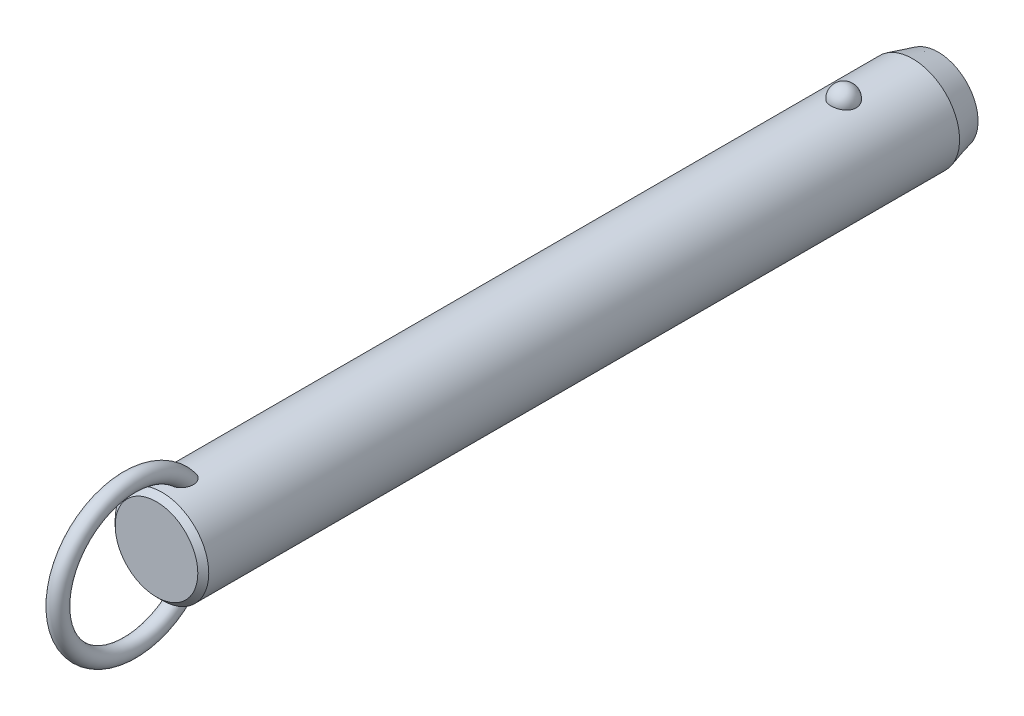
ISO-10303-21;
HEADER;
FILE_DESCRIPTION(('STEP AP214'),'2;1');
FILE_NAME('part.step','',(''),(''),'','','');
FILE_SCHEMA(('AUTOMOTIVE_DESIGN { 1 0 10303 214 1 1 1 1 }'));
ENDSEC;
DATA;
#1=APPLICATION_CONTEXT('core data for automotive mechanical design processes');
#2=APPLICATION_PROTOCOL_DEFINITION('international standard','automotive_design',2000,#1);
#3=PRODUCT_CONTEXT('',#1,'mechanical');
#4=PRODUCT('Part','Part','',(#3));
#5=PRODUCT_RELATED_PRODUCT_CATEGORY('part','',(#4));
#6=PRODUCT_DEFINITION_FORMATION('','',#4);
#7=PRODUCT_DEFINITION_CONTEXT('part definition',#1,'design');
#8=PRODUCT_DEFINITION('design','',#6,#7);
#9=PRODUCT_DEFINITION_SHAPE('','',#8);
#10=(LENGTH_UNIT() NAMED_UNIT(*) SI_UNIT(.MILLI.,.METRE.));
#11=(NAMED_UNIT(*) PLANE_ANGLE_UNIT() SI_UNIT($,.RADIAN.));
#12=(NAMED_UNIT(*) SI_UNIT($,.STERADIAN.) SOLID_ANGLE_UNIT());
#13=UNCERTAINTY_MEASURE_WITH_UNIT(LENGTH_MEASURE(1.E-05),#10,'distance_accuracy_value','');
#14=(GEOMETRIC_REPRESENTATION_CONTEXT(3) GLOBAL_UNCERTAINTY_ASSIGNED_CONTEXT((#13)) GLOBAL_UNIT_ASSIGNED_CONTEXT((#10,
#11,#12)) REPRESENTATION_CONTEXT('',''));
#15=CARTESIAN_POINT('',(0.,0.,0.));
#16=DIRECTION('',(0.,0.,1.));
#17=DIRECTION('',(1.,0.,0.));
#18=AXIS2_PLACEMENT_3D('',#15,#16,#17);
#19=CARTESIAN_POINT('',(0.,0.,147.3));
#20=DIRECTION('',(0.,0.,-1.));
#21=DIRECTION('',(-1.,0.,0.));
#22=AXIS2_PLACEMENT_3D('',#19,#20,#21);
#23=CYLINDRICAL_SURFACE('',#22,11.1);
#24=CARTESIAN_POINT('',(2.9724815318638,10.6945945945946,-3.));
#25=CARTESIAN_POINT('',(2.97247830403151,10.6945972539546,-2.83225059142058));
#26=CARTESIAN_POINT('',(2.95876598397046,10.6984356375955,-2.66445972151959));
#27=CARTESIAN_POINT('',(2.90424529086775,10.7133624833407,-2.33362381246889));
#28=CARTESIAN_POINT('',(2.8634252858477,10.7244540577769,-2.1705808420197));
#29=CARTESIAN_POINT('',(2.75573657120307,10.7526272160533,-1.85396767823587));
#30=CARTESIAN_POINT('',(2.68887937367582,10.7697061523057,-1.70039333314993));
#31=CARTESIAN_POINT('',(2.53079696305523,10.8079438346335,-1.40691598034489));
#32=CARTESIAN_POINT('',(2.43957264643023,10.8291024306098,-1.2670124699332));
#33=CARTESIAN_POINT('',(2.23458150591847,10.8732541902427,-1.00409565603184));
#34=CARTESIAN_POINT('',(2.12071295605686,10.8962553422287,-0.881162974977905));
#35=CARTESIAN_POINT('',(1.87365402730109,10.9414421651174,-0.656352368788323));
#36=CARTESIAN_POINT('',(1.74046358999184,10.9636278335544,-0.554474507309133));
#37=CARTESIAN_POINT('',(1.45872188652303,11.0046495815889,-0.374872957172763));
#38=CARTESIAN_POINT('',(1.31021276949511,11.0234944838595,-0.297085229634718));
#39=CARTESIAN_POINT('',(1.00170030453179,11.0557957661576,-0.167529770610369));
#40=CARTESIAN_POINT('',(0.841698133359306,11.0692526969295,-0.115759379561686));
#41=CARTESIAN_POINT('',(0.517607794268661,11.0890932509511,-0.0403925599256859));
#42=CARTESIAN_POINT('',(0.353633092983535,11.0955916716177,-0.0163383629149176));
#43=CARTESIAN_POINT('',(0.0238420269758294,11.1011989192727,0.0044517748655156));
#44=CARTESIAN_POINT('',(-0.141974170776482,11.1003084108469,0.00119017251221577));
#45=CARTESIAN_POINT('',(-0.468405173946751,11.0912990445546,-0.0323233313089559));
#46=CARTESIAN_POINT('',(-0.629059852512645,11.0832767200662,-0.0622147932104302));
#47=CARTESIAN_POINT('',(-0.942937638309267,11.0609962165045,-0.147645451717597));
#48=CARTESIAN_POINT('',(-1.09616062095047,11.0467379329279,-0.203185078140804));
#49=CARTESIAN_POINT('',(-1.39181061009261,11.0134071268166,-0.3387529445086));
#50=CARTESIAN_POINT('',(-1.53417383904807,10.9943086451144,-0.418913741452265));
#51=CARTESIAN_POINT('',(-1.80342160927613,10.9533667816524,-0.60144882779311));
#52=CARTESIAN_POINT('',(-1.9303046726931,10.9315231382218,-0.703825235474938));
#53=CARTESIAN_POINT('',(-2.16747598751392,10.887005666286,-0.930091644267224));
#54=CARTESIAN_POINT('',(-2.27742774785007,10.8643239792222,-1.05433291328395));
#55=CARTESIAN_POINT('',(-2.47517316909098,10.8209886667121,-1.31966633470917));
#56=CARTESIAN_POINT('',(-2.56296538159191,10.8003351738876,-1.46075958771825));
#57=CARTESIAN_POINT('',(-2.71500300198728,10.7631304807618,-1.75753646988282));
#58=CARTESIAN_POINT('',(-2.77898901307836,10.7466250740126,-1.91335887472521));
#59=CARTESIAN_POINT('',(-2.88046189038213,10.7198747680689,-2.2339152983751));
#60=CARTESIAN_POINT('',(-2.91794947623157,10.709629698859,-2.39864907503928));
#61=CARTESIAN_POINT('',(-2.96537819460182,10.6965949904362,-2.73165170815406));
#62=CARTESIAN_POINT('',(-2.97542891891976,10.693775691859,-2.89990378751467));
#63=CARTESIAN_POINT('',(-2.96804271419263,10.6958279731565,-3.235752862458));
#64=CARTESIAN_POINT('',(-2.95060646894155,10.7006993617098,-3.40334987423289));
#65=CARTESIAN_POINT('',(-2.88883358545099,10.71753912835,-3.73233906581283));
#66=CARTESIAN_POINT('',(-2.84462026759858,10.7294749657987,-3.89375610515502));
#67=CARTESIAN_POINT('',(-2.73050447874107,10.7590797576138,-4.20667949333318));
#68=CARTESIAN_POINT('',(-2.66060103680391,10.7767489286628,-4.35818546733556));
#69=CARTESIAN_POINT('',(-2.49642559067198,10.8159599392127,-4.6478542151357));
#70=CARTESIAN_POINT('',(-2.40203047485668,10.8375211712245,-4.78594458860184));
#71=CARTESIAN_POINT('',(-2.19143488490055,10.8820570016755,-5.0441038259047));
#72=CARTESIAN_POINT('',(-2.07523364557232,10.9050316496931,-5.16417205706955));
#73=CARTESIAN_POINT('',(-1.82361254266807,10.9499219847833,-5.38334833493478));
#74=CARTESIAN_POINT('',(-1.68812945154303,10.9718338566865,-5.48238464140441));
#75=CARTESIAN_POINT('',(-1.40191298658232,11.0120611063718,-5.65618873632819));
#76=CARTESIAN_POINT('',(-1.25118062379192,11.0303767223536,-5.73095813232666));
#77=CARTESIAN_POINT('',(-0.940570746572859,11.0611653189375,-5.85334725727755));
#78=CARTESIAN_POINT('',(-0.780821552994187,11.0737044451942,-5.90127578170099));
#79=CARTESIAN_POINT('',(-0.455204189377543,11.0918598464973,-5.96992976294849));
#80=CARTESIAN_POINT('',(-0.289336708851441,11.0974768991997,-5.99065827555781));
#81=CARTESIAN_POINT('',(0.0406846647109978,11.1011307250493,-6.00418773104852));
#82=CARTESIAN_POINT('',(0.204817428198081,11.099299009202,-5.99747318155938));
#83=CARTESIAN_POINT('',(0.5295530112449,11.088551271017,-5.9574031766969));
#84=CARTESIAN_POINT('',(0.69015594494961,11.0796354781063,-5.92404858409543));
#85=CARTESIAN_POINT('',(1.0027760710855,11.0557204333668,-5.83180084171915));
#86=CARTESIAN_POINT('',(1.15482001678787,11.0407414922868,-5.77299291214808));
#87=CARTESIAN_POINT('',(1.44678373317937,11.0062913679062,-5.63147366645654));
#88=CARTESIAN_POINT('',(1.58670279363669,10.9868199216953,-5.54876095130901));
#89=CARTESIAN_POINT('',(1.8527023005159,10.9451315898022,-5.36027644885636));
#90=CARTESIAN_POINT('',(1.97855158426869,10.9228788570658,-5.25418644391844));
#91=CARTESIAN_POINT('',(2.21080872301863,10.8782509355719,-5.02251354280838));
#92=CARTESIAN_POINT('',(2.31721312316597,10.8558757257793,-4.89692718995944));
#93=CARTESIAN_POINT('',(2.5094551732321,10.8130715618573,-4.62745408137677));
#94=CARTESIAN_POINT('',(2.59493284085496,10.7926798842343,-4.48330448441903));
#95=CARTESIAN_POINT('',(2.740862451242,10.7565495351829,-4.18236358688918));
#96=CARTESIAN_POINT('',(2.80132490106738,10.7408089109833,-4.02557762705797));
#97=CARTESIAN_POINT('',(2.88959070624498,10.7173718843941,-3.72475308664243));
#98=CARTESIAN_POINT('',(2.92062102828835,10.7088950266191,-3.58171216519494));
#99=CARTESIAN_POINT('',(2.96206765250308,10.6975052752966,-3.29245795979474));
#100=CARTESIAN_POINT('',(2.97248434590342,10.6945922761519,-3.14624473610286));
#101=CARTESIAN_POINT('',(2.9724815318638,10.6945945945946,-3.));
#102=B_SPLINE_CURVE_WITH_KNOTS('',3,(#24,#25,#26,#27,#28,#29,#30,#31,#32,#33,#34,#35,#36,#37,
#38,#39,#40,#41,#42,#43,#44,#45,#46,#47,#48,#49,#50,#51,#52,#53,#54,#55,#56,#57,#58,#59,#60,#61,
#62,#63,#64,#65,#66,#67,#68,#69,#70,#71,#72,#73,#74,#75,#76,#77,#78,#79,#80,#81,#82,#83,#84,#85,
#86,#87,#88,#89,#90,#91,#92,#93,#94,#95,#96,#97,#98,#99,#100,#101),.UNSPECIFIED.,.T.,.F.,(4,2,2,
2,2,2,2,2,2,2,2,2,2,2,2,2,2,2,2,2,2,2,2,2,2,2,2,2,2,2,2,2,2,2,2,2,2,2,4),(0.,0.502722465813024,
1.00566079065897,1.5083769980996,2.01107471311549,2.51608392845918,3.02109467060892,
3.52475118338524,4.02835620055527,4.523518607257,5.0186364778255,5.50715297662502,
5.9956776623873,6.48688002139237,6.97812923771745,7.47814366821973,7.9781907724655,
8.48353712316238,8.9888697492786,9.49218093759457,9.99547960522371,10.4964777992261,
10.997494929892,11.5010810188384,12.0046847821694,12.5099796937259,13.0152411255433,
13.5145635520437,14.0138298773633,14.5043200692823,14.9947943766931,15.4836390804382,
15.9725123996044,16.4685040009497,16.9645836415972,17.4686765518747,17.972557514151,
18.410841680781,18.849117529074),.UNSPECIFIED.);
#103=CARTESIAN_POINT('',(2.9724815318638,10.6945945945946,-3.));
#104=VERTEX_POINT('',#103);
#105=EDGE_CURVE('E41',#104,#104,#102,.T.);
#106=ORIENTED_EDGE('',*,*,#105,.T.);
#107=EDGE_LOOP('',(#106));
#108=FACE_BOUND('',#107,.T.);
#109=CARTESIAN_POINT('',(0.,0.,158.7));
#110=DIRECTION('',(0.,0.,1.));
#111=DIRECTION('',(1.,0.,0.));
#112=AXIS2_PLACEMENT_3D('',#109,#110,#111);
#113=CIRCLE('',#112,11.1);
#114=CARTESIAN_POINT('',(11.1,0.,158.7));
#115=VERTEX_POINT('',#114);
#116=EDGE_CURVE('E10',#115,#115,#113,.F.);
#117=ORIENTED_EDGE('',*,*,#116,.T.);
#118=EDGE_LOOP('',(#117));
#119=FACE_BOUND('',#118,.T.);
#120=CARTESIAN_POINT('',(-0.564520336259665,-11.0856356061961,150.957815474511));
#121=CARTESIAN_POINT('',(-0.667202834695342,-11.0804062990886,150.991283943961));
#122=CARTESIAN_POINT('',(-0.766875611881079,-11.0738877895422,151.033835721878));
#123=CARTESIAN_POINT('',(-0.957284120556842,-11.0590576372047,151.135419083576));
#124=CARTESIAN_POINT('',(-1.04801616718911,-11.0507452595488,151.19445742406));
#125=CARTESIAN_POINT('',(-1.21800952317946,-11.0333016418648,151.326529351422));
#126=CARTESIAN_POINT('',(-1.29730805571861,-11.0241732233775,151.399515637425));
#127=CARTESIAN_POINT('',(-1.44337665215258,-11.0060026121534,151.557037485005));
#128=CARTESIAN_POINT('',(-1.51014622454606,-10.9969604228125,151.641573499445));
#129=CARTESIAN_POINT('',(-1.63454620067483,-10.9791841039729,151.825521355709));
#130=CARTESIAN_POINT('',(-1.69127003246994,-10.9705107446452,151.925549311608));
#131=CARTESIAN_POINT('',(-1.7898078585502,-10.9548648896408,152.132790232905));
#132=CARTESIAN_POINT('',(-1.83161214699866,-10.9478935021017,152.240007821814));
#133=CARTESIAN_POINT('',(-1.91557028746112,-10.9335803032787,152.505408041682));
#134=CARTESIAN_POINT('',(-1.95040620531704,-10.9273269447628,152.665980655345));
#135=CARTESIAN_POINT('',(-1.99388326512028,-10.9194709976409,152.990697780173));
#136=CARTESIAN_POINT('',(-2.00248051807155,-10.9178762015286,153.154847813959));
#137=CARTESIAN_POINT('',(-1.99551615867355,-10.9191578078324,153.524650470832));
#138=CARTESIAN_POINT('',(-1.97322066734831,-10.9232807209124,153.730191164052));
#139=CARTESIAN_POINT('',(-1.91529761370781,-10.9335244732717,154.033595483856));
#140=CARTESIAN_POINT('',(-1.89184575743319,-10.9376266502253,154.134088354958));
#141=CARTESIAN_POINT('',(-1.83700674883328,-10.9469720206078,154.332855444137));
#142=CARTESIAN_POINT('',(-1.80562070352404,-10.9522150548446,154.431129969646));
#143=CARTESIAN_POINT('',(-1.73463055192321,-10.9636837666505,154.625914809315));
#144=CARTESIAN_POINT('',(-1.69493416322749,-10.9699202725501,154.722390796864));
#145=CARTESIAN_POINT('',(-1.60745141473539,-10.9830806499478,154.911626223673));
#146=CARTESIAN_POINT('',(-1.55966150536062,-10.9900048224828,155.004384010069));
#147=CARTESIAN_POINT('',(-1.45591812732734,-11.0042280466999,155.184690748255));
#148=CARTESIAN_POINT('',(-1.40000013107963,-11.0115253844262,155.272260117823));
#149=CARTESIAN_POINT('',(-1.27937470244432,-11.0261911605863,155.441029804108));
#150=CARTESIAN_POINT('',(-1.21467835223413,-11.0335594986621,155.52223795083));
#151=CARTESIAN_POINT('',(-1.08218150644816,-11.0473027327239,155.669001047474));
#152=CARTESIAN_POINT('',(-1.01522633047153,-11.0537063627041,155.735309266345));
#153=CARTESIAN_POINT('',(-0.872952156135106,-11.065850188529,155.858378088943));
#154=CARTESIAN_POINT('',(-0.797642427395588,-11.0715911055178,155.915149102));
#155=CARTESIAN_POINT('',(-0.651396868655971,-11.081071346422,156.007515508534));
#156=CARTESIAN_POINT('',(-0.581712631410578,-11.0849841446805,156.045049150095));
#157=CARTESIAN_POINT('',(-0.437066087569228,-11.0916271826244,156.108259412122));
#158=CARTESIAN_POINT('',(-0.362109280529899,-11.0943586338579,156.133948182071));
#159=CARTESIAN_POINT('',(-0.207828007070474,-11.0983242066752,156.171117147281));
#160=CARTESIAN_POINT('',(-0.12846771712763,-11.0995432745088,156.182454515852));
#161=CARTESIAN_POINT('',(0.0309101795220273,-11.1002423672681,156.188965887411));
#162=CARTESIAN_POINT('',(0.110927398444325,-11.0997233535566,156.184148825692));
#163=CARTESIAN_POINT('',(0.256406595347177,-11.097240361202,156.160959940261));
#164=CARTESIAN_POINT('',(0.322235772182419,-11.0955074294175,156.144754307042));
#165=CARTESIAN_POINT('',(0.450635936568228,-11.0910350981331,156.102600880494));
#166=CARTESIAN_POINT('',(0.513205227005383,-11.0882951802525,156.076648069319));
#167=CARTESIAN_POINT('',(0.662626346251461,-11.0805620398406,156.002607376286));
#168=CARTESIAN_POINT('',(0.747127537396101,-11.0751144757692,155.949845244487));
#169=CARTESIAN_POINT('',(0.906756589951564,-11.0631932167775,155.831720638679));
#170=CARTESIAN_POINT('',(0.981859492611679,-11.0567168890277,155.766325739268));
#171=CARTESIAN_POINT('',(1.10712207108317,-11.0447856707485,155.64226337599));
#172=CARTESIAN_POINT('',(1.15909566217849,-11.0394280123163,155.585383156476));
#173=CARTESIAN_POINT('',(1.25791923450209,-11.0286040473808,155.467327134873));
#174=CARTESIAN_POINT('',(1.30476642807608,-11.0231376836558,155.406149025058));
#175=CARTESIAN_POINT('',(1.43818612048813,-11.0068027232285,155.217305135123));
#176=CARTESIAN_POINT('',(1.51751767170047,-10.9960104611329,155.084453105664));
#177=CARTESIAN_POINT('',(1.63597546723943,-10.9788847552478,154.853137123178));
#178=CARTESIAN_POINT('',(1.67988876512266,-10.9722190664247,154.757053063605));
#179=CARTESIAN_POINT('',(1.75953241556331,-10.9597298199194,154.561431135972));
#180=CARTESIAN_POINT('',(1.79525967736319,-10.9539065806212,154.461891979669));
#181=CARTESIAN_POINT('',(1.85844731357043,-10.9433632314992,154.26021118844));
#182=CARTESIAN_POINT('',(1.8859107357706,-10.9386427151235,154.15807052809));
#183=CARTESIAN_POINT('',(1.93234324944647,-10.9305350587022,153.951819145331));
#184=CARTESIAN_POINT('',(1.95131065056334,-10.9271481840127,153.847708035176));
#185=CARTESIAN_POINT('',(1.9904020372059,-10.9201183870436,153.565458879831));
#186=CARTESIAN_POINT('',(2.00221217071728,-10.9179256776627,153.386037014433));
#187=CARTESIAN_POINT('',(1.99711676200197,-10.9188636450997,153.027713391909));
#188=CARTESIAN_POINT('',(1.98026150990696,-10.9219849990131,152.848811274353));
#189=CARTESIAN_POINT('',(1.92151657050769,-10.9324473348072,152.53645144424));
#190=CARTESIAN_POINT('',(1.88605081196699,-10.9386915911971,152.401759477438));
#191=CARTESIAN_POINT('',(1.79393020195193,-10.9541780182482,152.139966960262));
#192=CARTESIAN_POINT('',(1.73729868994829,-10.9634168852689,152.012858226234));
#193=CARTESIAN_POINT('',(1.61237037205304,-10.9824218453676,151.789418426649));
#194=CARTESIAN_POINT('',(1.54715374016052,-10.9918945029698,151.691345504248));
#195=CARTESIAN_POINT('',(1.40127026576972,-11.0114415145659,151.507434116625));
#196=CARTESIAN_POINT('',(1.32060742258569,-11.0215157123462,151.421592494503));
#197=CARTESIAN_POINT('',(1.1447478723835,-11.041168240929,151.265163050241));
#198=CARTESIAN_POINT('',(1.04947805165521,-11.0507437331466,151.194656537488));
#199=CARTESIAN_POINT('',(0.847278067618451,-11.0680789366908,151.072640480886));
#200=CARTESIAN_POINT('',(0.740351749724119,-11.0758392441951,151.021124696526));
#201=CARTESIAN_POINT('',(0.529289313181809,-11.0878275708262,150.943485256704));
#202=CARTESIAN_POINT('',(0.425895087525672,-11.0923259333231,150.915377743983));
#203=CARTESIAN_POINT('',(0.215723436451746,-11.0984001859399,150.877703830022));
#204=CARTESIAN_POINT('',(0.10894793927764,-11.0999777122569,150.868127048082));
#205=CARTESIAN_POINT('',(-0.0938962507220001,-11.1000196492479,150.867877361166));
#206=CARTESIAN_POINT('',(-0.189967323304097,-11.0987797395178,150.875408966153));
#207=CARTESIAN_POINT('',(-0.379657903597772,-11.0939111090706,150.905507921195));
#208=CARTESIAN_POINT('',(-0.473277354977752,-11.0902823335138,150.928075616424));
#209=CARTESIAN_POINT('',(-0.564520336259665,-11.0856356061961,150.957815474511));
#210=B_SPLINE_CURVE_WITH_KNOTS('',3,(#120,#121,#122,#123,#124,#125,#126,#127,#128,#129,#130,
#131,#132,#133,#134,#135,#136,#137,#138,#139,#140,#141,#142,#143,#144,#145,#146,#147,#148,#149,
#150,#151,#152,#153,#154,#155,#156,#157,#158,#159,#160,#161,#162,#163,#164,#165,#166,#167,#168,
#169,#170,#171,#172,#173,#174,#175,#176,#177,#178,#179,#180,#181,#182,#183,#184,#185,#186,#187,
#188,#189,#190,#191,#192,#193,#194,#195,#196,#197,#198,#199,#200,#201,#202,#203,#204,#205,#206,
#207,#208,#209),.UNSPECIFIED.,.T.,.F.,(4,2,2,2,2,2,2,2,2,2,2,2,2,2,2,2,2,2,2,2,2,2,2,2,2,2,2,2,
2,2,2,2,2,2,2,2,2,2,2,2,2,2,2,2,4),(0.,0.323999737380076,0.648132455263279,0.971184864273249,
1.29424994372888,1.63886237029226,1.98369857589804,2.47426059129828,2.96564271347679,
3.58257396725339,3.89215258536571,4.20168803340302,4.51486273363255,4.82817514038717,
5.14015911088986,5.45175282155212,5.73442856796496,6.01679375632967,6.25364580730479,
6.49025437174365,6.72919963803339,6.96801276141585,7.17061258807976,7.37331685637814,
7.67094989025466,7.96935728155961,8.20075067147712,8.43226927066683,8.89581623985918,
9.21306533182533,9.5304340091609,9.84768549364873,10.1650000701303,10.7022930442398,
11.2386443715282,11.655339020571,12.071575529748,12.4245637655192,12.7774607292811,
13.1321855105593,13.4867936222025,13.8068771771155,14.1267813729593,14.4146787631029,
14.7025827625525),.UNSPECIFIED.);
#211=CARTESIAN_POINT('',(-0.564520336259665,-11.0856356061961,150.957815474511));
#212=VERTEX_POINT('',#211);
#213=EDGE_CURVE('E59',#212,#212,#210,.T.);
#214=ORIENTED_EDGE('',*,*,#213,.T.);
#215=EDGE_LOOP('',(#214));
#216=FACE_BOUND('',#215,.T.);
#217=CARTESIAN_POINT('',(-0.564520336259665,11.0856356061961,150.957815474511));
#218=CARTESIAN_POINT('',(-0.468542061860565,11.0905203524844,150.926545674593));
#219=CARTESIAN_POINT('',(-0.369793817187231,11.0942886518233,150.903157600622));
#220=CARTESIAN_POINT('',(-0.169555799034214,11.0991586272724,150.873085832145));
#221=CARTESIAN_POINT('',(-0.0680604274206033,11.1002543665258,150.86643932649));
#222=CARTESIAN_POINT('',(0.13454973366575,11.099646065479,150.870157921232));
#223=CARTESIAN_POINT('',(0.235664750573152,11.0979441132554,150.88051033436));
#224=CARTESIAN_POINT('',(0.434632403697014,11.0919342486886,150.917831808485));
#225=CARTESIAN_POINT('',(0.532486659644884,11.0876276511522,150.944792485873));
#226=CARTESIAN_POINT('',(0.722445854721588,11.0768742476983,151.0144096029));
#227=CARTESIAN_POINT('',(0.814543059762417,11.0704246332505,151.057086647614));
#228=CARTESIAN_POINT('',(0.990565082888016,11.0560659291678,151.156648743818));
#229=CARTESIAN_POINT('',(1.07448844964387,11.048156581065,151.213536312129));
#230=CARTESIAN_POINT('',(1.23562672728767,11.0313221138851,151.342210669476));
#231=CARTESIAN_POINT('',(1.3124268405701,11.0223686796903,151.414511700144));
#232=CARTESIAN_POINT('',(1.45398030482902,11.0045918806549,151.570042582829));
#233=CARTESIAN_POINT('',(1.51873073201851,10.9957685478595,151.653275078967));
#234=CARTESIAN_POINT('',(1.64107232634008,10.9782087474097,151.836384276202));
#235=CARTESIAN_POINT('',(1.6974317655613,10.9695572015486,151.937089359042));
#236=CARTESIAN_POINT('',(1.79515063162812,10.9539887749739,152.145626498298));
#237=CARTESIAN_POINT('',(1.83649966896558,10.9470730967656,152.25346343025));
#238=CARTESIAN_POINT('',(1.91931148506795,10.9329211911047,152.520399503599));
#239=CARTESIAN_POINT('',(1.95340104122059,10.9267904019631,152.681861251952));
#240=CARTESIAN_POINT('',(1.99526195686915,10.9192174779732,153.00821631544));
#241=CARTESIAN_POINT('',(2.00298989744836,10.9177830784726,153.17311484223));
#242=CARTESIAN_POINT('',(1.99396251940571,10.9194420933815,153.544100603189));
#243=CARTESIAN_POINT('',(1.97050829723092,10.923774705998,153.75003871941));
#244=CARTESIAN_POINT('',(1.91079643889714,10.9343131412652,154.053901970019));
#245=CARTESIAN_POINT('',(1.88673702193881,10.9385106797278,154.154529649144));
#246=CARTESIAN_POINT('',(1.8306550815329,10.9480376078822,154.353510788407));
#247=CARTESIAN_POINT('',(1.79863369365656,10.9533668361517,154.451864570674));
#248=CARTESIAN_POINT('',(1.72633365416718,10.9649954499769,154.646720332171));
#249=CARTESIAN_POINT('',(1.68596409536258,10.9713053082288,154.74318790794));
#250=CARTESIAN_POINT('',(1.59707998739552,10.9845964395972,154.932323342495));
#251=CARTESIAN_POINT('',(1.54856169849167,10.9915780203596,155.024989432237));
#252=CARTESIAN_POINT('',(1.44330168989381,11.0058935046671,155.204975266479));
#253=CARTESIAN_POINT('',(1.3865974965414,11.0132257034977,155.292316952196));
#254=CARTESIAN_POINT('',(1.26431158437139,11.0279330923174,155.460456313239));
#255=CARTESIAN_POINT('',(1.19874160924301,11.0353082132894,155.541262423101));
#256=CARTESIAN_POINT('',(1.06542088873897,11.048931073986,155.685985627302));
#257=CARTESIAN_POINT('',(0.998640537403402,11.0552153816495,155.750784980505));
#258=CARTESIAN_POINT('',(0.856896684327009,11.0671032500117,155.870846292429));
#259=CARTESIAN_POINT('',(0.781942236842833,11.0727075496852,155.926118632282));
#260=CARTESIAN_POINT('',(0.636276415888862,11.081949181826,156.015972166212));
#261=CARTESIAN_POINT('',(0.566755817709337,11.0857572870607,156.052441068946));
#262=CARTESIAN_POINT('',(0.42260242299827,11.0921860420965,156.113533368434));
#263=CARTESIAN_POINT('',(0.347974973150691,11.0948079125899,156.138168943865));
#264=CARTESIAN_POINT('',(0.194593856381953,11.0985608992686,156.173323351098));
#265=CARTESIAN_POINT('',(0.115807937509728,11.0996777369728,156.183706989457));
#266=CARTESIAN_POINT('',(-0.0422499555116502,11.1002003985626,156.188574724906));
#267=CARTESIAN_POINT('',(-0.121521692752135,11.09960699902,156.183066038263));
#268=CARTESIAN_POINT('',(-0.266046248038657,11.0970123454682,156.158827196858));
#269=CARTESIAN_POINT('',(-0.331661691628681,11.0952283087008,156.142135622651));
#270=CARTESIAN_POINT('',(-0.45958809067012,11.0906663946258,156.099111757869));
#271=CARTESIAN_POINT('',(-0.52189737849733,11.0878880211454,156.072774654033));
#272=CARTESIAN_POINT('',(-0.671446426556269,11.0800342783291,155.997513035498));
#273=CARTESIAN_POINT('',(-0.756250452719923,11.0744969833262,155.943818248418));
#274=CARTESIAN_POINT('',(-0.916349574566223,11.0624045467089,155.823802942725));
#275=CARTESIAN_POINT('',(-0.991618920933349,11.0558467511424,155.757449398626));
#276=CARTESIAN_POINT('',(-1.11713140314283,11.0437783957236,155.631633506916));
#277=CARTESIAN_POINT('',(-1.16920539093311,11.0383619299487,155.573952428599));
#278=CARTESIAN_POINT('',(-1.26817476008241,11.02743010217,155.454280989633));
#279=CARTESIAN_POINT('',(-1.31506731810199,11.0219146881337,155.392288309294));
#280=CARTESIAN_POINT('',(-1.40399813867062,11.0109399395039,155.264784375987));
#281=CARTESIAN_POINT('',(-1.44602864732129,11.0054807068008,155.199267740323));
#282=CARTESIAN_POINT('',(-1.52538779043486,10.9947621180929,155.065422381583));
#283=CARTESIAN_POINT('',(-1.56271516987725,10.9895028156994,154.997092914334));
#284=CARTESIAN_POINT('',(-1.64537943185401,10.9774790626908,154.833210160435));
#285=CARTESIAN_POINT('',(-1.68879497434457,10.9708503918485,154.7366735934));
#286=CARTESIAN_POINT('',(-1.76740738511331,10.9584602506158,154.540236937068));
#287=CARTESIAN_POINT('',(-1.80260120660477,10.95269910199,154.44033561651));
#288=CARTESIAN_POINT('',(-1.86468657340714,10.9423003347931,154.237966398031));
#289=CARTESIAN_POINT('',(-1.8915816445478,10.9376622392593,154.135499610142));
#290=CARTESIAN_POINT('',(-1.93682458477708,10.9297405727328,153.928642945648));
#291=CARTESIAN_POINT('',(-1.95517082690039,10.9264572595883,153.824252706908));
#292=CARTESIAN_POINT('',(-1.99232562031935,10.9197647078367,153.54262876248));
#293=CARTESIAN_POINT('',(-2.00294603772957,10.9177914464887,153.364185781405));
#294=CARTESIAN_POINT('',(-1.99566675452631,10.9191290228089,153.007996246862));
#295=CARTESIAN_POINT('',(-1.97781651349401,10.9224306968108,152.83024902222));
#296=CARTESIAN_POINT('',(-1.91747214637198,10.9331592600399,152.519792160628));
#297=CARTESIAN_POINT('',(-1.88131022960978,10.9395108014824,152.385825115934));
#298=CARTESIAN_POINT('',(-1.78790380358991,10.9551659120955,152.12559757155));
#299=CARTESIAN_POINT('',(-1.73068309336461,10.9644661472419,151.999328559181));
#300=CARTESIAN_POINT('',(-1.60475573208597,10.9835398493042,151.77741565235));
#301=CARTESIAN_POINT('',(-1.53908879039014,10.9930297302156,151.680026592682));
#302=CARTESIAN_POINT('',(-1.39238608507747,11.0125708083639,151.497525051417));
#303=CARTESIAN_POINT('',(-1.31135150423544,11.0226219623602,151.412411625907));
#304=CARTESIAN_POINT('',(-1.14382035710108,11.0411991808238,151.26529943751));
#305=CARTESIAN_POINT('',(-1.0585850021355,11.0497792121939,151.20186930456));
#306=CARTESIAN_POINT('',(-0.878723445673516,11.0655285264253,151.090250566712));
#307=CARTESIAN_POINT('',(-0.784123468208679,11.0727015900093,151.042020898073));
#308=CARTESIAN_POINT('',(-0.646163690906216,11.0812501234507,150.986023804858));
#309=CARTESIAN_POINT('',(-0.605595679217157,11.0835451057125,150.971197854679));
#310=CARTESIAN_POINT('',(-0.564520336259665,11.0856356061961,150.957815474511));
#311=B_SPLINE_CURVE_WITH_KNOTS('',3,(#217,#218,#219,#220,#221,#222,#223,#224,#225,#226,#227,
#228,#229,#230,#231,#232,#233,#234,#235,#236,#237,#238,#239,#240,#241,#242,#243,#244,#245,#246,
#247,#248,#249,#250,#251,#252,#253,#254,#255,#256,#257,#258,#259,#260,#261,#262,#263,#264,#265,
#266,#267,#268,#269,#270,#271,#272,#273,#274,#275,#276,#277,#278,#279,#280,#281,#282,#283,#284,
#285,#286,#287,#288,#289,#290,#291,#292,#293,#294,#295,#296,#297,#298,#299,#300,#301,#302,#303,
#304,#305,#306,#307,#308,#309,#310),.UNSPECIFIED.,.T.,.F.,(4,2,2,2,2,2,2,2,2,2,2,2,2,2,2,2,2,2,
2,2,2,2,2,2,2,2,2,2,2,2,2,2,2,2,2,2,2,2,2,2,2,2,2,2,2,2,4),(0.,0.303061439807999,
0.606795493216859,0.910302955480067,1.21365733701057,1.51741085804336,1.82121821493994,
2.13745205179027,2.45376252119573,2.79958678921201,3.14564996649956,3.63832391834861,
4.13180893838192,4.75031912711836,5.06071926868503,5.37107516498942,5.68500772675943,
5.99908475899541,6.31176519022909,6.62403542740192,6.90315673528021,7.18197194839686,
7.41687778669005,7.65154134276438,7.88841587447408,8.12518286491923,8.32752842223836,
8.52997509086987,8.82986421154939,9.13054668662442,9.36393502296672,9.59744991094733,
9.83133221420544,10.0652767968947,10.3830324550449,10.7009056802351,11.0186436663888,
11.3364420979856,11.8705925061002,12.4038159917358,12.8189662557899,13.2336487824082,
13.5857049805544,13.9377340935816,14.2561354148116,14.5736690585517,14.7033687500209),.UNSPECIFIED.);
#312=CARTESIAN_POINT('',(-0.564520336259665,11.0856356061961,150.957815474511));
#313=VERTEX_POINT('',#312);
#314=EDGE_CURVE('E66',#313,#313,#311,.T.);
#315=ORIENTED_EDGE('',*,*,#314,.T.);
#316=EDGE_LOOP('',(#315));
#317=FACE_BOUND('',#316,.T.);
#318=CARTESIAN_POINT('',(0.,0.,-19.3999999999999));
#319=DIRECTION('',(0.,0.,-1.));
#320=DIRECTION('',(-1.,0.,0.));
#321=AXIS2_PLACEMENT_3D('',#318,#319,#320);
#322=CIRCLE('',#321,11.1);
#323=CARTESIAN_POINT('',(-11.1,0.,-19.3999999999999));
#324=VERTEX_POINT('',#323);
#325=EDGE_CURVE('E56',#324,#324,#322,.F.);
#326=ORIENTED_EDGE('',*,*,#325,.T.);
#327=EDGE_LOOP('',(#326));
#328=FACE_BOUND('',#327,.T.);
#329=ADVANCED_FACE('F37',(#108,#119,#216,#317,#328),#23,.T.);
#330=CARTESIAN_POINT('',(0.,0.,-25.4));
#331=DIRECTION('',(0.,0.,-1.));
#332=DIRECTION('',(-1.,0.,0.));
#333=AXIS2_PLACEMENT_3D('',#330,#331,#332);
#334=PLANE('',#333);
#335=CARTESIAN_POINT('',(0.,0.,-25.4));
#336=DIRECTION('',(0.,0.,-1.));
#337=DIRECTION('',(-1.,0.,0.));
#338=AXIS2_PLACEMENT_3D('',#335,#336,#337);
#339=CIRCLE('',#338,9.49230484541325);
#340=CARTESIAN_POINT('',(-9.49230484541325,0.,-25.4));
#341=VERTEX_POINT('',#340);
#342=EDGE_CURVE('E65',#341,#341,#339,.T.);
#343=ORIENTED_EDGE('',*,*,#342,.T.);
#344=EDGE_LOOP('',(#343));
#345=FACE_BOUND('',#344,.T.);
#346=ADVANCED_FACE('F84',(#345),#334,.T.);
#347=CARTESIAN_POINT('',(0.,0.,-25.4));
#348=DIRECTION('',(0.,0.,1.));
#349=DIRECTION('',(1.,0.,0.));
#350=AXIS2_PLACEMENT_3D('',#347,#348,#349);
#351=CONICAL_SURFACE('',#350,9.49230484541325,0.261799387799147);
#352=ORIENTED_EDGE('',*,*,#325,.F.);
#353=EDGE_LOOP('',(#352));
#354=FACE_BOUND('',#353,.T.);
#355=ORIENTED_EDGE('',*,*,#342,.F.);
#356=EDGE_LOOP('',(#355));
#357=FACE_BOUND('',#356,.T.);
#358=ADVANCED_FACE('F82',(#354,#357),#351,.T.);
#359=CARTESIAN_POINT('',(0.,0.,160.));
#360=DIRECTION('',(0.,0.,1.));
#361=DIRECTION('',(1.,0.,0.));
#362=AXIS2_PLACEMENT_3D('',#359,#360,#361);
#363=PLANE('',#362);
#364=CARTESIAN_POINT('',(0.,0.,160.));
#365=DIRECTION('',(0.,0.,1.));
#366=DIRECTION('',(1.,0.,0.));
#367=AXIS2_PLACEMENT_3D('',#364,#365,#366);
#368=CIRCLE('',#367,9.8);
#369=CARTESIAN_POINT('',(9.8,0.,160.));
#370=VERTEX_POINT('',#369);
#371=EDGE_CURVE('E50',#370,#370,#368,.T.);
#372=ORIENTED_EDGE('',*,*,#371,.T.);
#373=EDGE_LOOP('',(#372));
#374=FACE_BOUND('',#373,.T.);
#375=ADVANCED_FACE('F76',(#374),#363,.T.);
#376=CARTESIAN_POINT('',(0.,0.,166.35));
#377=DIRECTION('',(1.,0.,0.));
#378=DIRECTION('',(0.,0.,-1.));
#379=AXIS2_PLACEMENT_3D('',#376,#377,#378);
#380=TOROIDAL_SURFACE('',#379,17.05,2.);
#381=ORIENTED_EDGE('',*,*,#314,.F.);
#382=EDGE_LOOP('',(#381));
#383=FACE_BOUND('',#382,.T.);
#384=ORIENTED_EDGE('',*,*,#213,.F.);
#385=EDGE_LOOP('',(#384));
#386=FACE_BOUND('',#385,.T.);
#387=ADVANCED_FACE('F72',(#383,#386),#380,.T.);
#388=CARTESIAN_POINT('',(0.,0.,160.));
#389=DIRECTION('',(0.,0.,-1.));
#390=DIRECTION('',(-1.,0.,0.));
#391=AXIS2_PLACEMENT_3D('',#388,#389,#390);
#392=CONICAL_SURFACE('',#391,9.8,0.785398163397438);
#393=ORIENTED_EDGE('',*,*,#116,.F.);
#394=EDGE_LOOP('',(#393));
#395=FACE_BOUND('',#394,.T.);
#396=ORIENTED_EDGE('',*,*,#371,.F.);
#397=EDGE_LOOP('',(#396));
#398=FACE_BOUND('',#397,.T.);
#399=ADVANCED_FACE('F39',(#395,#398),#392,.T.);
#400=CARTESIAN_POINT('',(0.,11.1,-3.));
#401=DIRECTION('',(0.,1.,0.));
#402=DIRECTION('',(0.,0.,-1.));
#403=AXIS2_PLACEMENT_3D('',#400,#401,#402);
#404=SPHERICAL_SURFACE('',#403,3.);
#405=ORIENTED_EDGE('',*,*,#105,.F.);
#406=EDGE_LOOP('',(#405));
#407=FACE_BOUND('',#406,.T.);
#408=ADVANCED_FACE('F78',(#407),#404,.T.);
#409=CLOSED_SHELL('',(#329,#346,#358,#375,#387,#399,#408));
#410=MANIFOLD_SOLID_BREP('B2',#409);
#411=ADVANCED_BREP_SHAPE_REPRESENTATION('',(#18,#410),#14);
#412=SHAPE_DEFINITION_REPRESENTATION(#9,#411);
ENDSEC;
END-ISO-10303-21;
